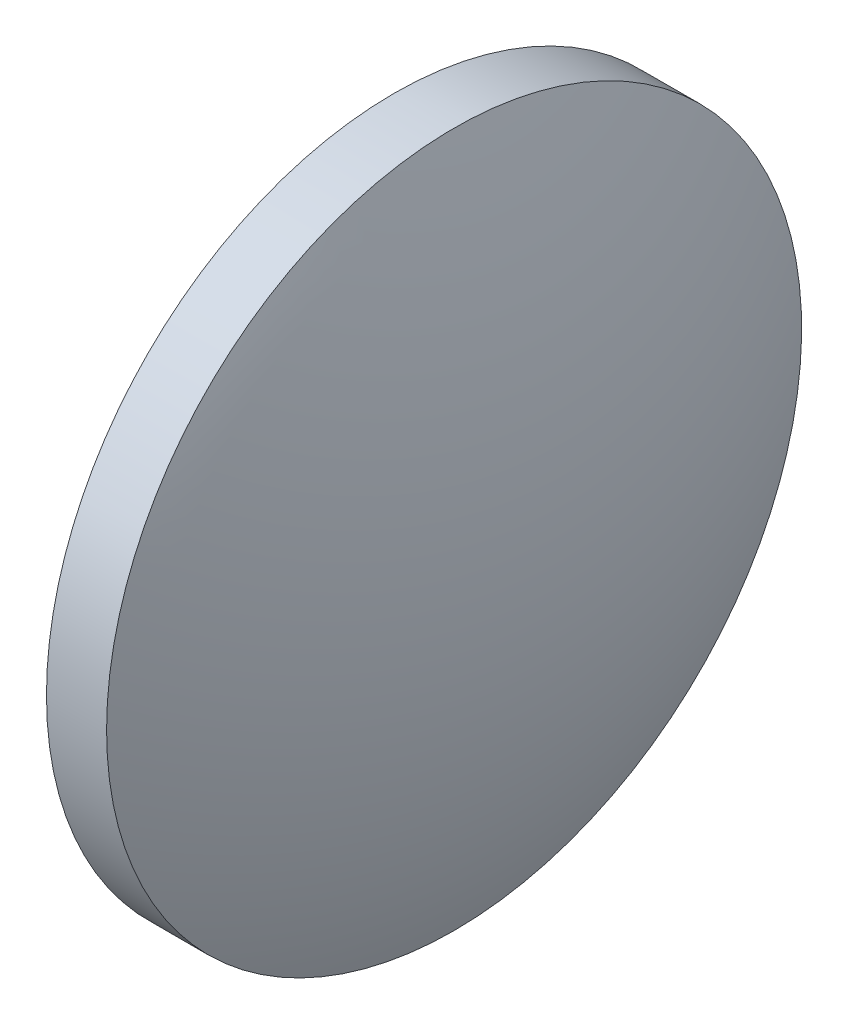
ISO-10303-21;
HEADER;
FILE_DESCRIPTION(('STEP AP214'),'2;1');
FILE_NAME('part.step','',(''),(''),'','','');
FILE_SCHEMA(('AUTOMOTIVE_DESIGN { 1 0 10303 214 1 1 1 1 }'));
ENDSEC;
DATA;
#1=APPLICATION_CONTEXT('core data for automotive mechanical design processes');
#2=APPLICATION_PROTOCOL_DEFINITION('international standard','automotive_design',2000,#1);
#3=PRODUCT_CONTEXT('',#1,'mechanical');
#4=PRODUCT('Part','Part','',(#3));
#5=PRODUCT_RELATED_PRODUCT_CATEGORY('part','',(#4));
#6=PRODUCT_DEFINITION_FORMATION('','',#4);
#7=PRODUCT_DEFINITION_CONTEXT('part definition',#1,'design');
#8=PRODUCT_DEFINITION('design','',#6,#7);
#9=PRODUCT_DEFINITION_SHAPE('','',#8);
#10=(LENGTH_UNIT() NAMED_UNIT(*) SI_UNIT(.MILLI.,.METRE.));
#11=(NAMED_UNIT(*) PLANE_ANGLE_UNIT() SI_UNIT($,.RADIAN.));
#12=(NAMED_UNIT(*) SI_UNIT($,.STERADIAN.) SOLID_ANGLE_UNIT());
#13=UNCERTAINTY_MEASURE_WITH_UNIT(LENGTH_MEASURE(1.E-05),#10,'distance_accuracy_value','');
#14=(GEOMETRIC_REPRESENTATION_CONTEXT(3) GLOBAL_UNCERTAINTY_ASSIGNED_CONTEXT((#13)) GLOBAL_UNIT_ASSIGNED_CONTEXT((#10,
#11,#12)) REPRESENTATION_CONTEXT('',''));
#15=CARTESIAN_POINT('',(0.,0.,0.));
#16=DIRECTION('',(0.,0.,1.));
#17=DIRECTION('',(1.,0.,0.));
#18=AXIS2_PLACEMENT_3D('',#15,#16,#17);
#19=CARTESIAN_POINT('',(33.5586538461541,0.,0.));
#20=DIRECTION('',(-1.,0.,0.));
#21=DIRECTION('',(0.,1.,0.));
#22=AXIS2_PLACEMENT_3D('',#19,#20,#21);
#23=SPHERICAL_SURFACE('',#22,33.5586538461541);
#24=CARTESIAN_POINT('',(1.3,0.,0.));
#25=DIRECTION('',(-1.,0.,0.));
#26=DIRECTION('',(0.,0.,1.));
#27=AXIS2_PLACEMENT_3D('',#24,#25,#26);
#28=CIRCLE('',#27,9.25);
#29=CARTESIAN_POINT('',(1.3,0.,9.25));
#30=VERTEX_POINT('',#29);
#31=EDGE_CURVE('E10',#30,#30,#28,.T.);
#32=ORIENTED_EDGE('',*,*,#31,.T.);
#33=EDGE_LOOP('',(#32));
#34=FACE_BOUND('',#33,.T.);
#35=ADVANCED_FACE('F39',(#34),#23,.T.);
#36=CARTESIAN_POINT('',(-1.77055103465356,0.,0.));
#37=DIRECTION('',(-1.,0.,0.));
#38=DIRECTION('',(0.,0.,1.));
#39=AXIS2_PLACEMENT_3D('',#36,#37,#38);
#40=CYLINDRICAL_SURFACE('',#39,9.25);
#41=ORIENTED_EDGE('',*,*,#31,.F.);
#42=EDGE_LOOP('',(#41));
#43=FACE_BOUND('',#42,.T.);
#44=CARTESIAN_POINT('',(2.89999999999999,0.,0.));
#45=DIRECTION('',(-1.,0.,0.));
#46=DIRECTION('',(0.,0.,1.));
#47=AXIS2_PLACEMENT_3D('',#44,#45,#46);
#48=CIRCLE('',#47,9.25);
#49=CARTESIAN_POINT('',(2.89999999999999,0.,9.25));
#50=VERTEX_POINT('',#49);
#51=EDGE_CURVE('E46',#50,#50,#48,.T.);
#52=ORIENTED_EDGE('',*,*,#51,.T.);
#53=EDGE_LOOP('',(#52));
#54=FACE_BOUND('',#53,.T.);
#55=ADVANCED_FACE('F53',(#43,#54),#40,.T.);
#56=CARTESIAN_POINT('',(-18.666447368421,0.,0.));
#57=DIRECTION('',(-1.,0.,0.));
#58=DIRECTION('',(0.,-1.,0.));
#59=AXIS2_PLACEMENT_3D('',#56,#57,#58);
#60=SPHERICAL_SURFACE('',#59,23.466447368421);
#61=ORIENTED_EDGE('',*,*,#51,.F.);
#62=EDGE_LOOP('',(#61));
#63=FACE_BOUND('',#62,.T.);
#64=ADVANCED_FACE('F55',(#63),#60,.T.);
#65=CLOSED_SHELL('',(#35,#55,#64));
#66=MANIFOLD_SOLID_BREP('B2',#65);
#67=ADVANCED_BREP_SHAPE_REPRESENTATION('',(#18,#66),#14);
#68=SHAPE_DEFINITION_REPRESENTATION(#9,#67);
ENDSEC;
END-ISO-10303-21;
